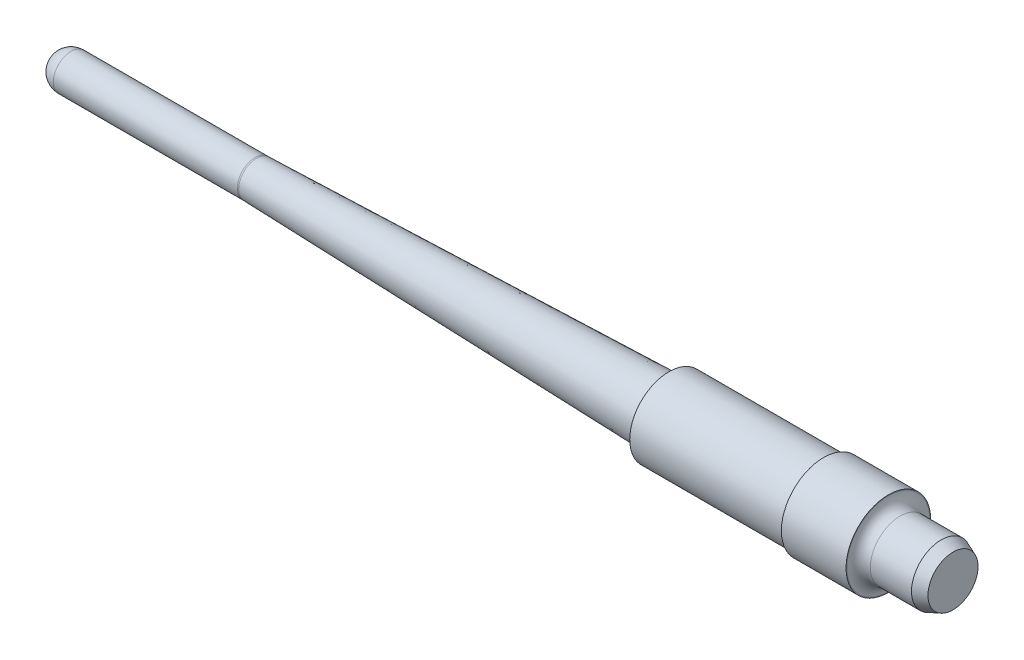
ISO-10303-21;
HEADER;
FILE_DESCRIPTION(('STEP AP214'),'2;1');
FILE_NAME('part.step','',(''),(''),'','','');
FILE_SCHEMA(('AUTOMOTIVE_DESIGN { 1 0 10303 214 1 1 1 1 }'));
ENDSEC;
DATA;
#1=APPLICATION_CONTEXT('core data for automotive mechanical design processes');
#2=APPLICATION_PROTOCOL_DEFINITION('international standard','automotive_design',2000,#1);
#3=PRODUCT_CONTEXT('',#1,'mechanical');
#4=PRODUCT('Part','Part','',(#3));
#5=PRODUCT_RELATED_PRODUCT_CATEGORY('part','',(#4));
#6=PRODUCT_DEFINITION_FORMATION('','',#4);
#7=PRODUCT_DEFINITION_CONTEXT('part definition',#1,'design');
#8=PRODUCT_DEFINITION('design','',#6,#7);
#9=PRODUCT_DEFINITION_SHAPE('','',#8);
#10=(LENGTH_UNIT() NAMED_UNIT(*) SI_UNIT(.MILLI.,.METRE.));
#11=(NAMED_UNIT(*) PLANE_ANGLE_UNIT() SI_UNIT($,.RADIAN.));
#12=(NAMED_UNIT(*) SI_UNIT($,.STERADIAN.) SOLID_ANGLE_UNIT());
#13=UNCERTAINTY_MEASURE_WITH_UNIT(LENGTH_MEASURE(1.E-05),#10,'distance_accuracy_value','');
#14=(GEOMETRIC_REPRESENTATION_CONTEXT(3) GLOBAL_UNCERTAINTY_ASSIGNED_CONTEXT((#13)) GLOBAL_UNIT_ASSIGNED_CONTEXT((#10,
#11,#12)) REPRESENTATION_CONTEXT('',''));
#15=CARTESIAN_POINT('',(0.,0.,0.));
#16=DIRECTION('',(0.,0.,1.));
#17=DIRECTION('',(1.,0.,0.));
#18=AXIS2_PLACEMENT_3D('',#15,#16,#17);
#19=CARTESIAN_POINT('',(0.,0.,0.));
#20=DIRECTION('',(-1.,0.,0.));
#21=DIRECTION('',(0.,1.,0.));
#22=AXIS2_PLACEMENT_3D('',#19,#20,#21);
#23=SPHERICAL_SURFACE('',#22,1.15570000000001);
#24=CARTESIAN_POINT('',(0.,0.,0.));
#25=DIRECTION('',(-1.,0.,0.));
#26=DIRECTION('',(0.,0.,1.));
#27=AXIS2_PLACEMENT_3D('',#24,#25,#26);
#28=CIRCLE('',#27,1.15570000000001);
#29=CARTESIAN_POINT('',(0.,0.,1.15570000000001));
#30=VERTEX_POINT('',#29);
#31=EDGE_CURVE('E10',#30,#30,#28,.T.);
#32=ORIENTED_EDGE('',*,*,#31,.T.);
#33=EDGE_LOOP('',(#32));
#34=FACE_BOUND('',#33,.T.);
#35=ADVANCED_FACE('F30',(#34),#23,.T.);
#36=CARTESIAN_POINT('',(0.,0.,0.));
#37=DIRECTION('',(-1.,0.,0.));
#38=DIRECTION('',(0.,0.,1.));
#39=AXIS2_PLACEMENT_3D('',#36,#37,#38);
#40=CYLINDRICAL_SURFACE('',#39,1.15570000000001);
#41=ORIENTED_EDGE('',*,*,#31,.F.);
#42=EDGE_LOOP('',(#41));
#43=FACE_BOUND('',#42,.T.);
#44=CARTESIAN_POINT('',(11.9253,0.,0.));
#45=DIRECTION('',(-1.,0.,0.));
#46=DIRECTION('',(0.,0.,1.));
#47=AXIS2_PLACEMENT_3D('',#44,#45,#46);
#48=CIRCLE('',#47,1.1557);
#49=CARTESIAN_POINT('',(11.9253,0.,1.1557));
#50=VERTEX_POINT('',#49);
#51=EDGE_CURVE('E36',#50,#50,#48,.T.);
#52=ORIENTED_EDGE('',*,*,#51,.T.);
#53=EDGE_LOOP('',(#52));
#54=FACE_BOUND('',#53,.T.);
#55=ADVANCED_FACE('F92',(#43,#54),#40,.T.);
#56=CARTESIAN_POINT('',(11.9253,0.,0.));
#57=DIRECTION('',(-1.,0.,0.));
#58=DIRECTION('',(0.,0.,1.));
#59=AXIS2_PLACEMENT_3D('',#56,#57,#58);
#60=TOROIDAL_SURFACE('',#59,4.3307,3.175);
#61=ORIENTED_EDGE('',*,*,#51,.F.);
#62=EDGE_LOOP('',(#61));
#63=FACE_BOUND('',#62,.T.);
#64=CARTESIAN_POINT('',(12.0186276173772,0.,0.));
#65=DIRECTION('',(-1.,0.,0.));
#66=DIRECTION('',(0.,0.,1.));
#67=AXIS2_PLACEMENT_3D('',#64,#65,#66);
#68=CIRCLE('',#67,1.15707195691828);
#69=CARTESIAN_POINT('',(12.0186276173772,0.,1.15707195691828));
#70=VERTEX_POINT('',#69);
#71=EDGE_CURVE('E40',#70,#70,#68,.T.);
#72=ORIENTED_EDGE('',*,*,#71,.T.);
#73=EDGE_LOOP('',(#72));
#74=FACE_BOUND('',#73,.T.);
#75=ADVANCED_FACE('F96',(#63,#74),#60,.F.);
#76=CARTESIAN_POINT('',(38.3778993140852,0.,0.));
#77=DIRECTION('',(1.,0.,0.));
#78=DIRECTION('',(0.,0.,-1.));
#79=AXIS2_PLACEMENT_3D('',#76,#77,#78);
#80=CONICAL_SURFACE('',#79,1.93222518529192,0.0293987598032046);
#81=ORIENTED_EDGE('',*,*,#71,.F.);
#82=EDGE_LOOP('',(#81));
#83=FACE_BOUND('',#82,.T.);
#84=CARTESIAN_POINT('',(38.3778993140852,0.,0.));
#85=DIRECTION('',(-1.,0.,0.));
#86=DIRECTION('',(0.,0.,1.));
#87=AXIS2_PLACEMENT_3D('',#84,#85,#86);
#88=CIRCLE('',#87,1.93222518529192);
#89=CARTESIAN_POINT('',(38.3778993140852,0.,1.93222518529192));
#90=VERTEX_POINT('',#89);
#91=EDGE_CURVE('E44',#90,#90,#88,.T.);
#92=ORIENTED_EDGE('',*,*,#91,.T.);
#93=EDGE_LOOP('',(#92));
#94=FACE_BOUND('',#93,.T.);
#95=ADVANCED_FACE('F101',(#83,#94),#80,.T.);
#96=CARTESIAN_POINT('',(38.3667,0.,0.));
#97=DIRECTION('',(-1.,0.,0.));
#98=DIRECTION('',(0.,0.,1.));
#99=AXIS2_PLACEMENT_3D('',#96,#97,#98);
#100=TOROIDAL_SURFACE('',#99,2.31306055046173,0.381);
#101=ORIENTED_EDGE('',*,*,#91,.F.);
#102=EDGE_LOOP('',(#101));
#103=FACE_BOUND('',#102,.T.);
#104=CARTESIAN_POINT('',(38.7477,0.,0.));
#105=DIRECTION('',(-1.,0.,0.));
#106=DIRECTION('',(0.,0.,1.));
#107=AXIS2_PLACEMENT_3D('',#104,#105,#106);
#108=CIRCLE('',#107,2.31306055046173);
#109=CARTESIAN_POINT('',(38.7477,0.,2.31306055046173));
#110=VERTEX_POINT('',#109);
#111=EDGE_CURVE('E49',#110,#110,#108,.T.);
#112=ORIENTED_EDGE('',*,*,#111,.T.);
#113=EDGE_LOOP('',(#112));
#114=FACE_BOUND('',#113,.T.);
#115=ADVANCED_FACE('F107',(#103,#114),#100,.F.);
#116=CARTESIAN_POINT('',(38.7477,2.31306055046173,0.));
#117=DIRECTION('',(1.,0.,0.));
#118=DIRECTION('',(0.,0.,-1.));
#119=AXIS2_PLACEMENT_3D('',#116,#117,#118);
#120=PLANE('',#119);
#121=ORIENTED_EDGE('',*,*,#111,.F.);
#122=EDGE_LOOP('',(#121));
#123=FACE_BOUND('',#122,.T.);
#124=CARTESIAN_POINT('',(38.7477,0.,0.));
#125=DIRECTION('',(-1.,0.,0.));
#126=DIRECTION('',(0.,0.,1.));
#127=AXIS2_PLACEMENT_3D('',#124,#125,#126);
#128=CIRCLE('',#127,2.54);
#129=CARTESIAN_POINT('',(38.7477,0.,2.54));
#130=VERTEX_POINT('',#129);
#131=EDGE_CURVE('E52',#130,#130,#128,.T.);
#132=ORIENTED_EDGE('',*,*,#131,.T.);
#133=EDGE_LOOP('',(#132));
#134=FACE_BOUND('',#133,.T.);
#135=ADVANCED_FACE('F111',(#123,#134),#120,.F.);
#136=CARTESIAN_POINT('',(0.,0.,0.));
#137=DIRECTION('',(-1.,0.,0.));
#138=DIRECTION('',(0.,0.,1.));
#139=AXIS2_PLACEMENT_3D('',#136,#137,#138);
#140=CYLINDRICAL_SURFACE('',#139,2.54);
#141=ORIENTED_EDGE('',*,*,#131,.F.);
#142=EDGE_LOOP('',(#141));
#143=FACE_BOUND('',#142,.T.);
#144=CARTESIAN_POINT('',(48.6664,0.,0.));
#145=DIRECTION('',(-1.,0.,0.));
#146=DIRECTION('',(0.,0.,1.));
#147=AXIS2_PLACEMENT_3D('',#144,#145,#146);
#148=CIRCLE('',#147,2.54);
#149=CARTESIAN_POINT('',(48.6664,0.,2.54));
#150=VERTEX_POINT('',#149);
#151=EDGE_CURVE('E55',#150,#150,#148,.T.);
#152=ORIENTED_EDGE('',*,*,#151,.T.);
#153=EDGE_LOOP('',(#152));
#154=FACE_BOUND('',#153,.T.);
#155=ADVANCED_FACE('F115',(#143,#154),#140,.T.);
#156=CARTESIAN_POINT('',(48.6664,0.,0.));
#157=DIRECTION('',(-1.,0.,0.));
#158=DIRECTION('',(0.,0.,1.));
#159=AXIS2_PLACEMENT_3D('',#156,#157,#158);
#160=TOROIDAL_SURFACE('',#159,2.6543,0.114299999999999);
#161=ORIENTED_EDGE('',*,*,#151,.F.);
#162=EDGE_LOOP('',(#161));
#163=FACE_BOUND('',#162,.T.);
#164=CARTESIAN_POINT('',(48.7807,0.,0.));
#165=DIRECTION('',(-1.,0.,0.));
#166=DIRECTION('',(0.,0.,1.));
#167=AXIS2_PLACEMENT_3D('',#164,#165,#166);
#168=CIRCLE('',#167,2.6543);
#169=CARTESIAN_POINT('',(48.7807,0.,2.6543));
#170=VERTEX_POINT('',#169);
#171=EDGE_CURVE('E58',#170,#170,#168,.T.);
#172=ORIENTED_EDGE('',*,*,#171,.T.);
#173=EDGE_LOOP('',(#172));
#174=FACE_BOUND('',#173,.T.);
#175=ADVANCED_FACE('F119',(#163,#174),#160,.F.);
#176=CARTESIAN_POINT('',(48.7807,2.6543,0.));
#177=DIRECTION('',(1.,0.,0.));
#178=DIRECTION('',(0.,0.,-1.));
#179=AXIS2_PLACEMENT_3D('',#176,#177,#178);
#180=PLANE('',#179);
#181=ORIENTED_EDGE('',*,*,#171,.F.);
#182=EDGE_LOOP('',(#181));
#183=FACE_BOUND('',#182,.T.);
#184=CARTESIAN_POINT('',(48.7807,0.,0.));
#185=DIRECTION('',(-1.,0.,0.));
#186=DIRECTION('',(0.,0.,1.));
#187=AXIS2_PLACEMENT_3D('',#184,#185,#186);
#188=CIRCLE('',#187,2.7432);
#189=CARTESIAN_POINT('',(48.7807,0.,2.7432));
#190=VERTEX_POINT('',#189);
#191=EDGE_CURVE('E61',#190,#190,#188,.T.);
#192=ORIENTED_EDGE('',*,*,#191,.T.);
#193=EDGE_LOOP('',(#192));
#194=FACE_BOUND('',#193,.T.);
#195=ADVANCED_FACE('F123',(#183,#194),#180,.F.);
#196=CARTESIAN_POINT('',(0.,0.,0.));
#197=DIRECTION('',(-1.,0.,0.));
#198=DIRECTION('',(0.,0.,1.));
#199=AXIS2_PLACEMENT_3D('',#196,#197,#198);
#200=CYLINDRICAL_SURFACE('',#199,2.7432);
#201=ORIENTED_EDGE('',*,*,#191,.F.);
#202=EDGE_LOOP('',(#201));
#203=FACE_BOUND('',#202,.T.);
#204=CARTESIAN_POINT('',(52.9717,0.,0.));
#205=DIRECTION('',(-1.,0.,0.));
#206=DIRECTION('',(0.,0.,1.));
#207=AXIS2_PLACEMENT_3D('',#204,#205,#206);
#208=CIRCLE('',#207,2.7432);
#209=CARTESIAN_POINT('',(52.9717,0.,2.7432));
#210=VERTEX_POINT('',#209);
#211=EDGE_CURVE('E64',#210,#210,#208,.T.);
#212=ORIENTED_EDGE('',*,*,#211,.T.);
#213=EDGE_LOOP('',(#212));
#214=FACE_BOUND('',#213,.T.);
#215=ADVANCED_FACE('F127',(#203,#214),#200,.T.);
#216=CARTESIAN_POINT('',(52.9717,2.7432,0.));
#217=DIRECTION('',(-1.,0.,0.));
#218=DIRECTION('',(0.,0.,1.));
#219=AXIS2_PLACEMENT_3D('',#216,#217,#218);
#220=PLANE('',#219);
#221=ORIENTED_EDGE('',*,*,#211,.F.);
#222=EDGE_LOOP('',(#221));
#223=FACE_BOUND('',#222,.T.);
#224=CARTESIAN_POINT('',(52.9717,0.,0.));
#225=DIRECTION('',(-1.,0.,0.));
#226=DIRECTION('',(0.,0.,1.));
#227=AXIS2_PLACEMENT_3D('',#224,#225,#226);
#228=CIRCLE('',#227,2.69240000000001);
#229=CARTESIAN_POINT('',(52.9717,0.,2.69240000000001));
#230=VERTEX_POINT('',#229);
#231=EDGE_CURVE('E67',#230,#230,#228,.T.);
#232=ORIENTED_EDGE('',*,*,#231,.T.);
#233=EDGE_LOOP('',(#232));
#234=FACE_BOUND('',#233,.T.);
#235=ADVANCED_FACE('F131',(#223,#234),#220,.F.);
#236=CARTESIAN_POINT('',(53.7337,0.,0.));
#237=DIRECTION('',(-1.,0.,0.));
#238=DIRECTION('',(0.,0.,1.));
#239=AXIS2_PLACEMENT_3D('',#236,#237,#238);
#240=TOROIDAL_SURFACE('',#239,2.6924,0.761999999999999);
#241=ORIENTED_EDGE('',*,*,#231,.F.);
#242=EDGE_LOOP('',(#241));
#243=FACE_BOUND('',#242,.T.);
#244=CARTESIAN_POINT('',(53.7337,0.,0.));
#245=DIRECTION('',(-1.,0.,0.));
#246=DIRECTION('',(0.,0.,1.));
#247=AXIS2_PLACEMENT_3D('',#244,#245,#246);
#248=CIRCLE('',#247,1.9304);
#249=CARTESIAN_POINT('',(53.7337,0.,1.9304));
#250=VERTEX_POINT('',#249);
#251=EDGE_CURVE('E70',#250,#250,#248,.T.);
#252=ORIENTED_EDGE('',*,*,#251,.T.);
#253=EDGE_LOOP('',(#252));
#254=FACE_BOUND('',#253,.T.);
#255=ADVANCED_FACE('F135',(#243,#254),#240,.F.);
#256=CARTESIAN_POINT('',(0.,0.,0.));
#257=DIRECTION('',(-1.,0.,0.));
#258=DIRECTION('',(0.,0.,1.));
#259=AXIS2_PLACEMENT_3D('',#256,#257,#258);
#260=CYLINDRICAL_SURFACE('',#259,1.9304);
#261=ORIENTED_EDGE('',*,*,#251,.F.);
#262=EDGE_LOOP('',(#261));
#263=FACE_BOUND('',#262,.T.);
#264=CARTESIAN_POINT('',(56.4007,0.,0.));
#265=DIRECTION('',(-1.,0.,0.));
#266=DIRECTION('',(0.,0.,1.));
#267=AXIS2_PLACEMENT_3D('',#264,#265,#266);
#268=CIRCLE('',#267,1.9304);
#269=CARTESIAN_POINT('',(56.4007,0.,1.9304));
#270=VERTEX_POINT('',#269);
#271=EDGE_CURVE('E73',#270,#270,#268,.T.);
#272=ORIENTED_EDGE('',*,*,#271,.T.);
#273=EDGE_LOOP('',(#272));
#274=FACE_BOUND('',#273,.T.);
#275=ADVANCED_FACE('F88',(#263,#274),#260,.T.);
#276=CARTESIAN_POINT('',(57.1627,0.,0.));
#277=DIRECTION('',(-1.,0.,0.));
#278=DIRECTION('',(0.,0.,1.));
#279=AXIS2_PLACEMENT_3D('',#276,#277,#278);
#280=CONICAL_SURFACE('',#279,1.62253201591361,0.383972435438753);
#281=ORIENTED_EDGE('',*,*,#271,.F.);
#282=EDGE_LOOP('',(#281));
#283=FACE_BOUND('',#282,.T.);
#284=CARTESIAN_POINT('',(57.1627,0.,0.));
#285=DIRECTION('',(-1.,0.,0.));
#286=DIRECTION('',(0.,0.,1.));
#287=AXIS2_PLACEMENT_3D('',#284,#285,#286);
#288=CIRCLE('',#287,1.62253201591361);
#289=CARTESIAN_POINT('',(57.1627,0.,1.62253201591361));
#290=VERTEX_POINT('',#289);
#291=EDGE_CURVE('E76',#290,#290,#288,.T.);
#292=ORIENTED_EDGE('',*,*,#291,.T.);
#293=EDGE_LOOP('',(#292));
#294=FACE_BOUND('',#293,.T.);
#295=ADVANCED_FACE('F80',(#283,#294),#280,.T.);
#296=CARTESIAN_POINT('',(57.1627,1.62253201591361,0.));
#297=DIRECTION('',(-1.,0.,0.));
#298=DIRECTION('',(0.,0.,1.));
#299=AXIS2_PLACEMENT_3D('',#296,#297,#298);
#300=PLANE('',#299);
#301=ORIENTED_EDGE('',*,*,#291,.F.);
#302=EDGE_LOOP('',(#301));
#303=FACE_BOUND('',#302,.T.);
#304=ADVANCED_FACE('F82',(#303),#300,.F.);
#305=CLOSED_SHELL('',(#35,#55,#75,#95,#115,#135,#155,#175,#195,#215,#235,#255,#275,#295,#304));
#306=MANIFOLD_SOLID_BREP('B2',#305);
#307=ADVANCED_BREP_SHAPE_REPRESENTATION('',(#18,#306),#14);
#308=SHAPE_DEFINITION_REPRESENTATION(#9,#307);
ENDSEC;
END-ISO-10303-21;
